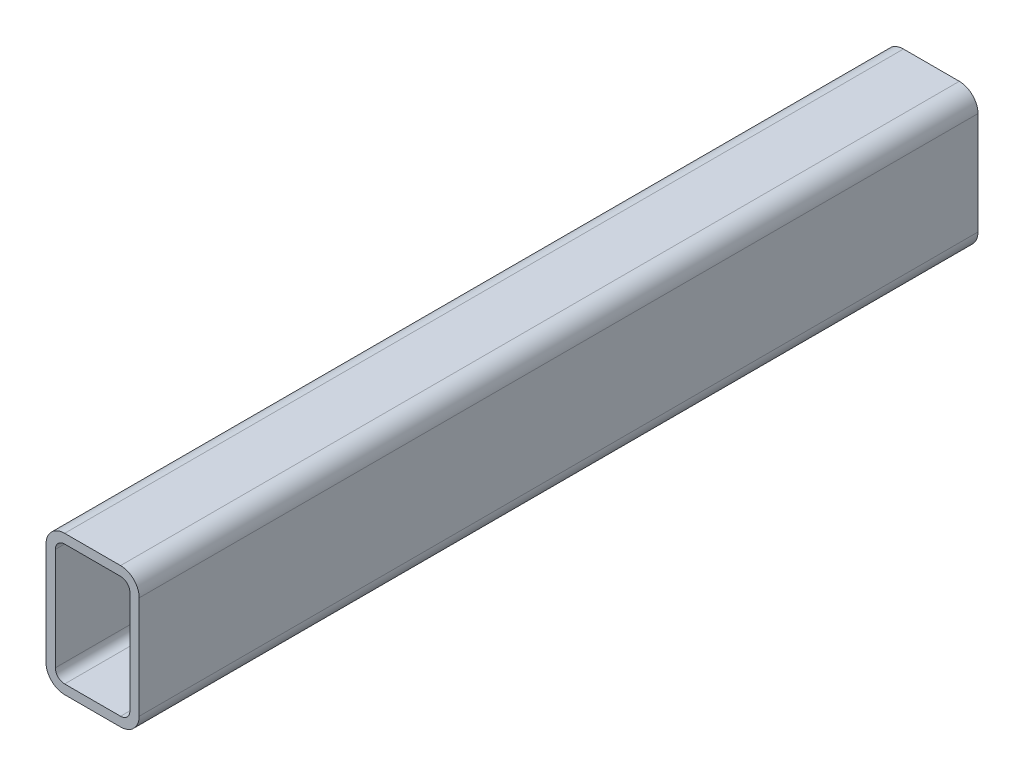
from build123d import *

# Parameters (mm, degrees)
EXTRUSION1_DEPTH = 450


with BuildPart() as part:
    # Esquisse1 → Extrusion1 (new, symmetric)
    with BuildSketch(Plane.XY):
        with BuildLine():
            Line((20, 0), (80, 0))
            ThreePointArc((80, 0), (94.142135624, 5.857864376), (100, 20))
            Line((100, 20), (100, 130))
            ThreePointArc((100, 130), (94.142135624, 144.142135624), (80, 150))
            Line((80, 150), (20, 150))
            ThreePointArc((20, 150), (5.857864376, 144.142135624), (0, 130))
            Line((0, 130), (0, 20))
            ThreePointArc((0, 20), (5.857864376, 5.857864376), (20, 0))
        make_face()
        with BuildLine():
            Line((80, 140), (20, 140))
            ThreePointArc((20, 140), (12.928932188, 137.071067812), (10, 130))
            Line((10, 130), (10, 20))
            ThreePointArc((10, 20), (12.928932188, 12.928932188), (20, 10))
            Line((20, 10), (80, 10))
            ThreePointArc((80, 10), (87.071067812, 12.928932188), (90, 20))
            Line((90, 20), (90, 130))
            ThreePointArc((90, 130), (87.071067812, 137.071067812), (80, 140))
        make_face(mode=Mode.SUBTRACT)
    extrude(amount=EXTRUSION1_DEPTH, both=True)


solid = part.part
